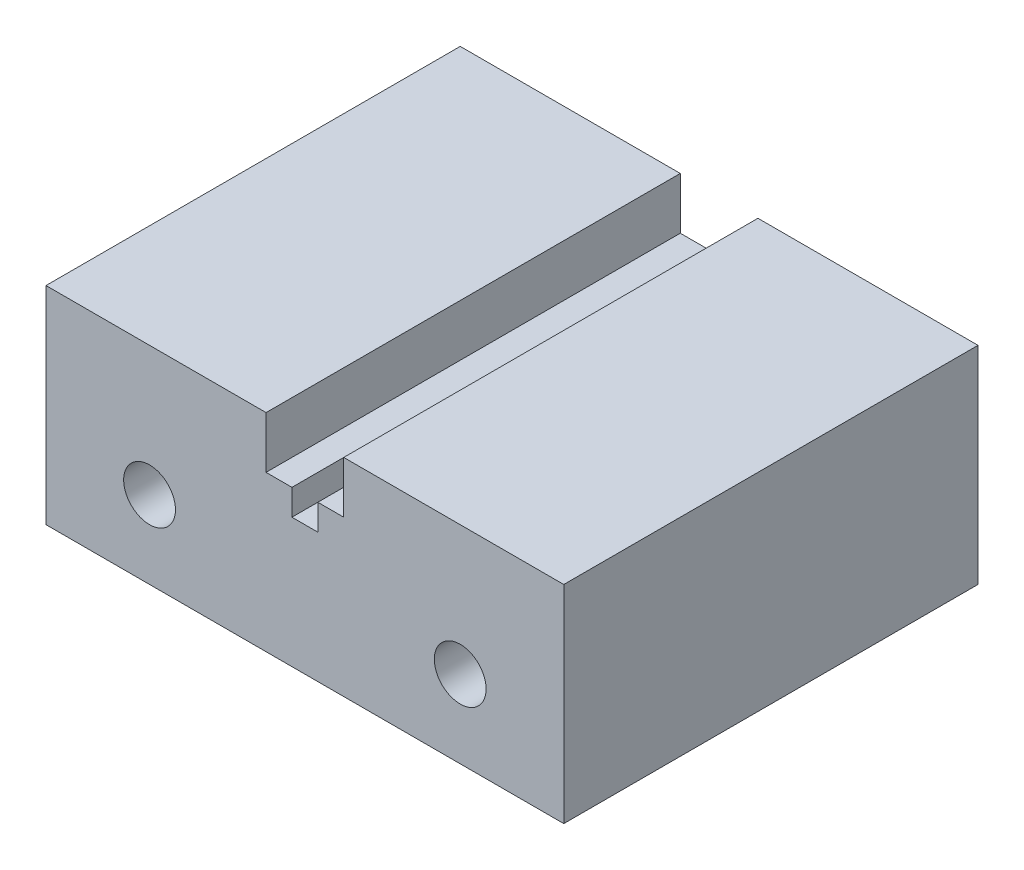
from build123d import *

# Parameters (mm, degrees)
SKETCH1_R           = 5
BOSS_EXTRUDE1_DEPTH = 80


with BuildPart() as part:
    # Sketch1 → Boss-Extrude1 (new body)
    with BuildSketch(Plane.XY):
        Polygon((0, 0), (100, 0), (100, 40), (57.5, 40), (57.5, 30), (52.5, 30), (52.5, 25), (47.5, 25), (47.5, 30), (42.5, 30), (42.5, 40), (0, 40), align=None)
        with Locations((20, 15)):
            Circle(SKETCH1_R, mode=Mode.SUBTRACT)
        with Locations((80, 15)):
            Circle(SKETCH1_R, mode=Mode.SUBTRACT)
    extrude(amount=BOSS_EXTRUDE1_DEPTH)


solid = part.part
